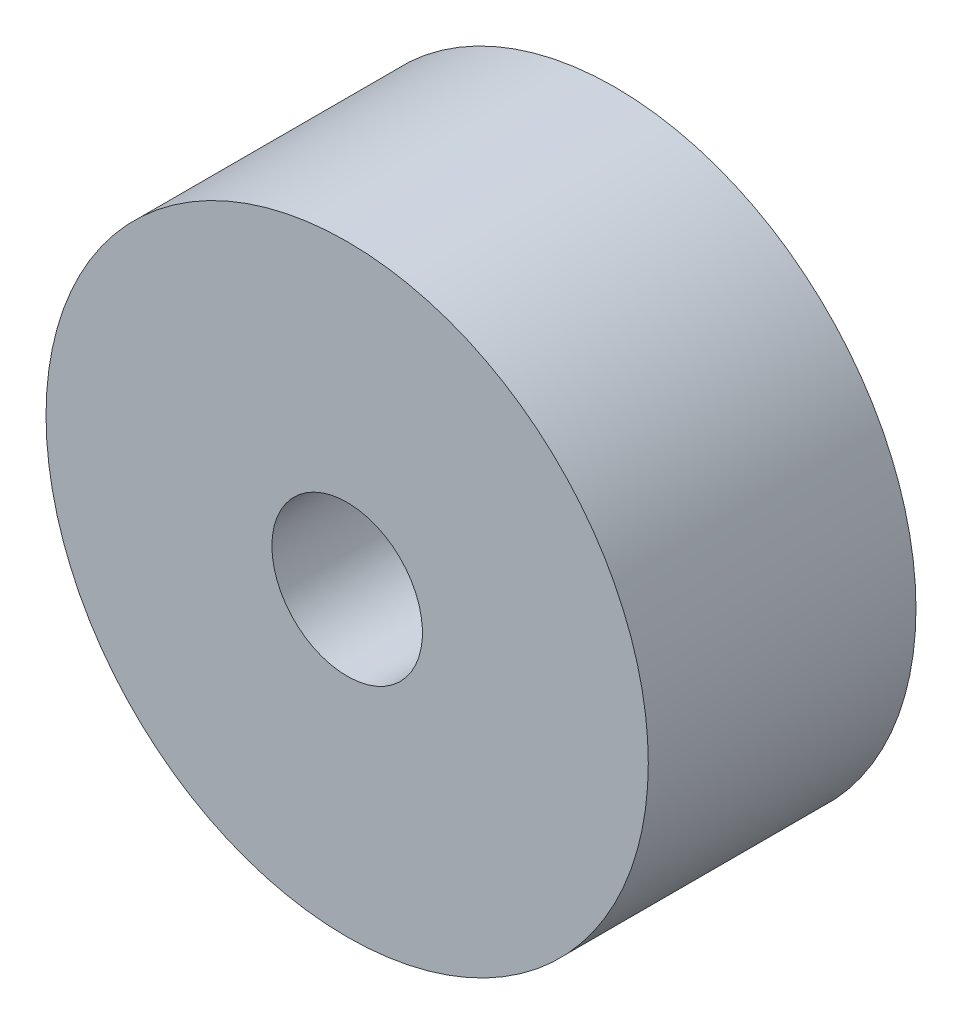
from build123d import *

# Parameters (mm, degrees)
ESQUISSE1_R             = 9
EXTRUSION1_DEPTH        = 8
ESQUISSE2_R             = 2.25
ENL_V_MAT_EXTRU_1_DEPTH = 16.033296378
CHANFREIN1_SIZE         = 2.5


with BuildPart() as part:
    # Esquisse1 → Extrusion1 (new body)
    with BuildSketch(Plane.XY):
        Circle(ESQUISSE1_R)
    extrude(amount=EXTRUSION1_DEPTH)

    # Esquisse2 → Enl_v. mat.-Extru.1 (cut, through all)
    with BuildSketch(Plane(origin=(0, 0, 0), x_dir=(-1, 0, 0), z_dir=(0, 0, -1))):
        Circle(ESQUISSE2_R)
    extrude(amount=-ENL_V_MAT_EXTRU_1_DEPTH, mode=Mode.SUBTRACT)

    # Chanfrein1
    chanfrein1_edges = [part.edges().sort_by_distance(p)[0] for p in [
        (2.25, 0, 0),
    ]]
    chamfer(chanfrein1_edges, length=CHANFREIN1_SIZE)


solid = part.part
